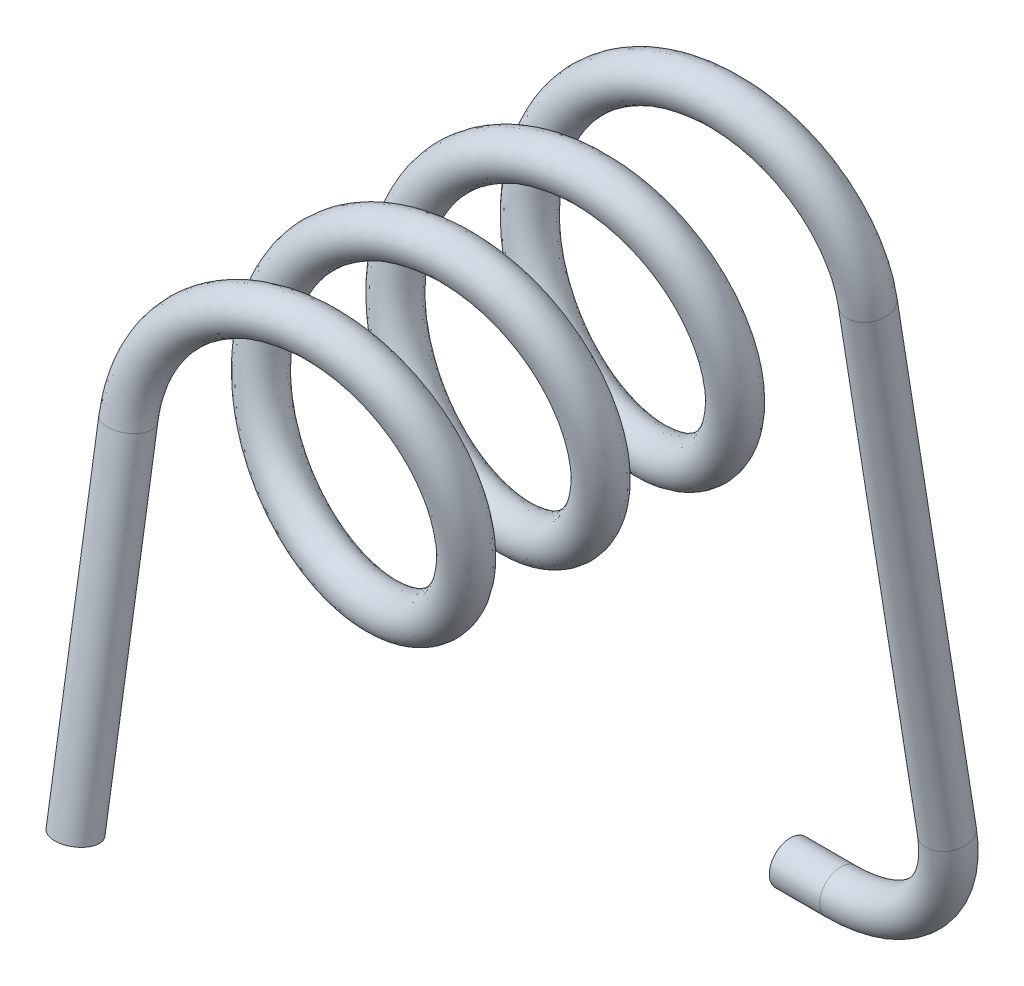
from build123d import *

# Parameters (mm, degrees)
SWEEP1_PITCH        = 8
SWEEP1_HEIGHT       = 28
SWEEP1_RADIUS       = 8
SKETCH15_R          = 1.25
SKETCH16_R          = 1.25
BOSS_EXTRUDE1_DEPTH = 30
SKETCH20_R          = 1.25
SKETCH21_R          = 1.25
BOSS_EXTRUDE2_DEPTH = 20


with BuildPart() as part:
    # Sweep1: sweep along a helix
    with BuildLine() as sweep1_path:
        Helix(SWEEP1_PITCH, SWEEP1_HEIGHT, SWEEP1_RADIUS, center=(0, 0, 0), direction=(0, 0, 1))
    # Sketch15 → Sweep1 (sweep)
    with BuildSketch(Plane(origin=(8, 0, 0), x_dir=(-1, 0, 0), z_dir=(0, 0.987570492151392, 0.15717672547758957))):
        Circle(SKETCH15_R)
    sweep(path=sweep1_path.line, is_frenet=True)

    # Sketch16 → Boss-Extrude1 (add)
    with BuildSketch(Plane(origin=(0, 0, 0), x_dir=(1, 0, 0), z_dir=(0, -0.987570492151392, -0.15717672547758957))):
        with Locations(Location((8, 0, 0), (0, 0, 90))):
            Circle(SKETCH16_R)
    extrude(amount=BOSS_EXTRUDE1_DEPTH)

    # Sweep2: sweep along a path in Sketch19
    with BuildLine(Plane(origin=(0, 0, 0), x_dir=(1, 0, 0), z_dir=(0, -0.15717672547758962, 0.987570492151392))) as sweep2_path:
        Line((-2.5, -37.5), (0.5, -37.5))
        ThreePointArc((0.5, -37.5), (5.803300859, -35.303300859), (8, -30))
    # Sketch20 → Sweep2 (sweep)
    with BuildSketch(Plane(origin=(0, -29.627114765, -4.715301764), x_dir=(1, 0, 0), z_dir=(0, -0.987570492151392, -0.15717672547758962))):
        with Locations((8, 0)):
            Circle(SKETCH20_R)
    sweep(path=sweep2_path.line)

    # Sketch21 → Boss-Extrude2 (add)
    with BuildSketch(Plane(origin=(0, -4.346246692, 0.691726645), x_dir=(1, 0, 0), z_dir=(0, -0.9875704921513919, 0.1571767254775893))):
        with Locations(Location((-8, 27.65197378, 0), (0, 0, 90))):
            Circle(SKETCH21_R)
    extrude(amount=BOSS_EXTRUDE2_DEPTH)


solid = part.part
